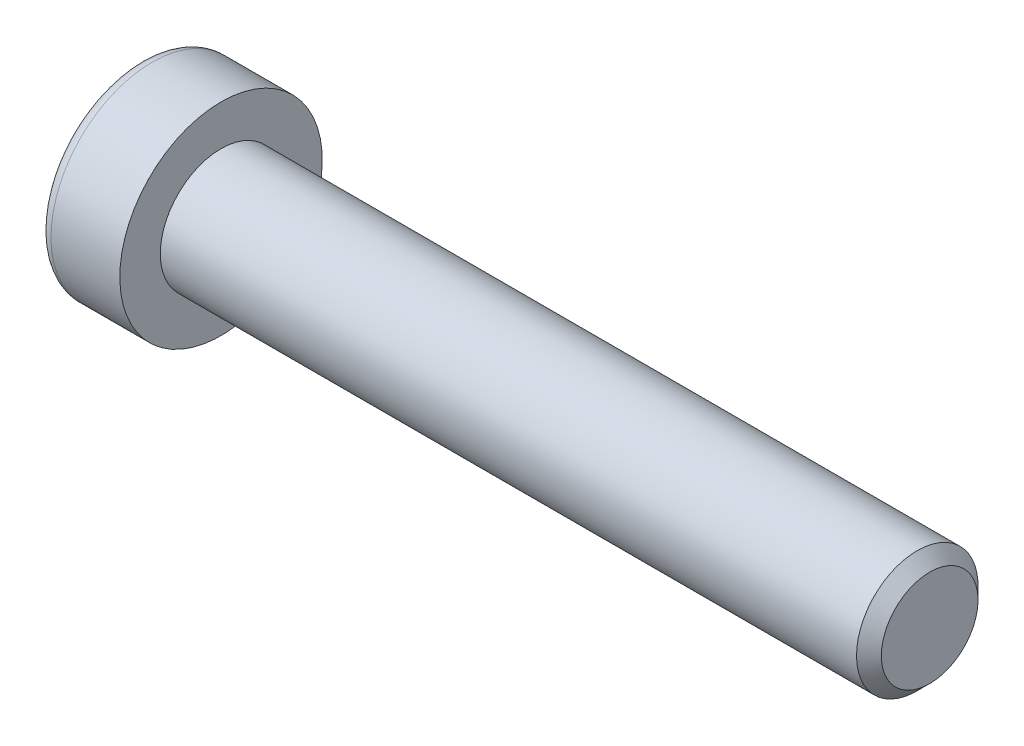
ISO-10303-21;
HEADER;
FILE_DESCRIPTION(('STEP AP214'),'2;1');
FILE_NAME('part.step','',(''),(''),'','','');
FILE_SCHEMA(('AUTOMOTIVE_DESIGN { 1 0 10303 214 1 1 1 1 }'));
ENDSEC;
DATA;
#1=APPLICATION_CONTEXT('core data for automotive mechanical design processes');
#2=APPLICATION_PROTOCOL_DEFINITION('international standard','automotive_design',2000,#1);
#3=PRODUCT_CONTEXT('',#1,'mechanical');
#4=PRODUCT('Part','Part','',(#3));
#5=PRODUCT_RELATED_PRODUCT_CATEGORY('part','',(#4));
#6=PRODUCT_DEFINITION_FORMATION('','',#4);
#7=PRODUCT_DEFINITION_CONTEXT('part definition',#1,'design');
#8=PRODUCT_DEFINITION('design','',#6,#7);
#9=PRODUCT_DEFINITION_SHAPE('','',#8);
#10=(LENGTH_UNIT() NAMED_UNIT(*) SI_UNIT(.MILLI.,.METRE.));
#11=(NAMED_UNIT(*) PLANE_ANGLE_UNIT() SI_UNIT($,.RADIAN.));
#12=(NAMED_UNIT(*) SI_UNIT($,.STERADIAN.) SOLID_ANGLE_UNIT());
#13=UNCERTAINTY_MEASURE_WITH_UNIT(LENGTH_MEASURE(1.E-05),#10,'distance_accuracy_value','');
#14=(GEOMETRIC_REPRESENTATION_CONTEXT(3) GLOBAL_UNCERTAINTY_ASSIGNED_CONTEXT((#13)) GLOBAL_UNIT_ASSIGNED_CONTEXT((#10,
#11,#12)) REPRESENTATION_CONTEXT('',''));
#15=CARTESIAN_POINT('',(0.,0.,0.));
#16=DIRECTION('',(0.,0.,1.));
#17=DIRECTION('',(1.,0.,0.));
#18=AXIS2_PLACEMENT_3D('',#15,#16,#17);
#19=CARTESIAN_POINT('',(-1.00800000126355,0.,0.));
#20=DIRECTION('',(-1.,0.,0.));
#21=DIRECTION('',(0.,0.,1.));
#22=AXIS2_PLACEMENT_3D('',#19,#20,#21);
#23=CONICAL_SURFACE('',#22,2.32325748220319,1.04719754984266);
#24=CARTESIAN_POINT('',(0.333333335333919,-2.27373675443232E-10,0.));
#25=VERTEX_POINT('',#24);
#26=VERTEX_LOOP('',#25);
#27=FACE_BOUND('',#26,.T.);
#28=CARTESIAN_POINT('',(-1.00000000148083,2.00000000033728,1.15470053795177));
#29=CARTESIAN_POINT('',(-0.970695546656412,2.00000000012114,1.05321634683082));
#30=CARTESIAN_POINT('',(-0.944044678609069,2.00000000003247,0.950856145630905));
#31=CARTESIAN_POINT('',(-0.897526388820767,1.99999999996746,0.744363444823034));
#32=CARTESIAN_POINT('',(-0.877675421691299,1.99999999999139,0.640227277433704));
#33=CARTESIAN_POINT('',(-0.84677596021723,2.0000000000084,0.433245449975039));
#34=CARTESIAN_POINT('',(-0.835521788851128,2.00000000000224,0.330431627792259));
#35=CARTESIAN_POINT('',(-0.822089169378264,1.99999999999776,0.124320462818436));
#36=CARTESIAN_POINT('',(-0.819899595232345,1.99999999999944,0.021023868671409));
#37=CARTESIAN_POINT('',(-0.824466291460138,2.00000000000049,-0.17197473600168));
#38=CARTESIAN_POINT('',(-0.830101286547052,2.00000000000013,-0.261705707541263));
#39=CARTESIAN_POINT('',(-0.847957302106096,1.99999999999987,-0.440583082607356));
#40=CARTESIAN_POINT('',(-0.86018441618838,1.99999999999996,-0.529728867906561));
#41=CARTESIAN_POINT('',(-0.890749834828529,2.00000000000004,-0.708974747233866));
#42=CARTESIAN_POINT('',(-0.909217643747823,2.00000000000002,-0.799052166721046));
#43=CARTESIAN_POINT('',(-0.95113176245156,1.99999999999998,-0.977863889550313));
#44=CARTESIAN_POINT('',(-0.974568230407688,1.99999999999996,-1.06660048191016));
#45=CARTESIAN_POINT('',(-1.00000000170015,2.,-1.15470053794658));
#46=B_SPLINE_CURVE_WITH_KNOTS('',3,(#28,#29,#30,#31,#32,#33,#34,#35,#36,#37,#38,#39,#40,#41,#42,
#43,#44,#45),.UNSPECIFIED.,.F.,.F.,(4,2,2,2,2,2,2,2,4),(0.,0.317016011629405,0.634793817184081,
0.944707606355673,1.25424088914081,1.52370778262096,1.79342419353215,2.06912162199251,
2.34427797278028),.UNSPECIFIED.);
#47=CARTESIAN_POINT('',(-1.00000000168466,1.99999999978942,1.15470053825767));
#48=VERTEX_POINT('',#47);
#49=CARTESIAN_POINT('',(-1.00000000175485,2.,-1.15470053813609));
#50=VERTEX_POINT('',#49);
#51=EDGE_CURVE('E20',#48,#50,#46,.T.);
#52=ORIENTED_EDGE('',*,*,#51,.T.);
#53=CARTESIAN_POINT('',(-1.00000000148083,1.99999999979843,-1.15470053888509));
#54=CARTESIAN_POINT('',(-0.970695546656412,1.91211211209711,-1.20544263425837));
#55=CARTESIAN_POINT('',(-0.944044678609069,1.82346557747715,-1.25662273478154));
#56=CARTESIAN_POINT('',(-0.897526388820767,1.64463765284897,-1.35986908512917));
#57=CARTESIAN_POINT('',(-0.877675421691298,1.55445308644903,-1.41193716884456));
#58=CARTESIAN_POINT('',(-0.846775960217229,1.37520156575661,-1.51542808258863));
#59=CARTESIAN_POINT('',(-0.835521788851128,1.28616218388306,-1.56683499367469));
#60=CARTESIAN_POINT('',(-0.822089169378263,1.10766467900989,-1.66989057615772));
#61=CARTESIAN_POINT('',(-0.819899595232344,1.01820720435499,-1.72153887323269));
#62=CARTESIAN_POINT('',(-0.824466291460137,0.851065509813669,-1.81803817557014));
#63=CARTESIAN_POINT('',(-0.830101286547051,0.773356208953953,-1.86290366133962));
#64=CARTESIAN_POINT('',(-0.847957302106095,0.618443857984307,-1.95234234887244));
#65=CARTESIAN_POINT('',(-0.860184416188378,0.541241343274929,-1.99691524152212));
#66=CARTESIAN_POINT('',(-0.890749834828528,0.38600985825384,-2.08653818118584));
#67=CARTESIAN_POINT('',(-0.909217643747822,0.308000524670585,-2.13157689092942));
#68=CARTESIAN_POINT('',(-0.951131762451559,0.153145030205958,-2.22098275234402));
#69=CARTESIAN_POINT('',(-0.974568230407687,0.0762968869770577,-2.26535104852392));
#70=CARTESIAN_POINT('',(-1.00000000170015,3.74707656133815E-10,-2.30940107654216));
#71=B_SPLINE_CURVE_WITH_KNOTS('',3,(#53,#54,#55,#56,#57,#58,#59,#60,#61,#62,#63,#64,#65,#66,#67,
#68,#69,#70),.UNSPECIFIED.,.F.,.F.,(4,2,2,2,2,2,2,2,4),(0.,0.317016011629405,0.63479381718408,
0.944707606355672,1.25424088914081,1.52370778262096,1.79342419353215,2.06912162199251,
2.34427797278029),.UNSPECIFIED.);
#72=CARTESIAN_POINT('',(-1.00000000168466,0.,-2.30940107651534));
#73=VERTEX_POINT('',#72);
#74=EDGE_CURVE('E80',#50,#73,#71,.T.);
#75=ORIENTED_EDGE('',*,*,#74,.T.);
#76=CARTESIAN_POINT('',(-1.00000000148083,-5.38851016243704E-10,-2.30940107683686));
#77=CARTESIAN_POINT('',(-0.970695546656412,-0.0878878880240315,-2.2586589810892));
#78=CARTESIAN_POINT('',(-0.944044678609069,-0.176534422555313,-2.20747888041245));
#79=CARTESIAN_POINT('',(-0.897526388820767,-0.355362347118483,-2.10423252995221));
#80=CARTESIAN_POINT('',(-0.877675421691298,-0.445546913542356,-2.05216444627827));
#81=CARTESIAN_POINT('',(-0.846775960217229,-0.624798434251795,-1.94867353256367));
#82=CARTESIAN_POINT('',(-0.835521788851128,-0.713837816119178,-1.89726662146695));
#83=CARTESIAN_POINT('',(-0.822089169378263,-0.892335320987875,-1.79421103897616));
#84=CARTESIAN_POINT('',(-0.819899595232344,-0.98179279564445,-1.7425627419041));
#85=CARTESIAN_POINT('',(-0.824466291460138,-1.14893449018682,-1.64606343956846));
#86=CARTESIAN_POINT('',(-0.830101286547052,-1.22664379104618,-1.60119795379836));
#87=CARTESIAN_POINT('',(-0.847957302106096,-1.38155614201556,-1.51175926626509));
#88=CARTESIAN_POINT('',(-0.860184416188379,-1.45875865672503,-1.46718637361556));
#89=CARTESIAN_POINT('',(-0.890749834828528,-1.6139901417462,-1.37756343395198));
#90=CARTESIAN_POINT('',(-0.909217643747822,-1.69199947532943,-1.33252472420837));
#91=CARTESIAN_POINT('',(-0.951131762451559,-1.84685496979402,-1.2431188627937));
#92=CARTESIAN_POINT('',(-0.974568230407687,-1.9237031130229,-1.19875056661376));
#93=CARTESIAN_POINT('',(-1.00000000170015,-1.99999999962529,-1.15470053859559));
#94=B_SPLINE_CURVE_WITH_KNOTS('',3,(#76,#77,#78,#79,#80,#81,#82,#83,#84,#85,#86,#87,#88,#89,#90,
#91,#92,#93),.UNSPECIFIED.,.F.,.F.,(4,2,2,2,2,2,2,2,4),(0.,0.317016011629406,0.634793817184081,
0.944707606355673,1.25424088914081,1.52370778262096,1.79342419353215,2.06912162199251,
2.34427797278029),.UNSPECIFIED.);
#95=CARTESIAN_POINT('',(-1.00000000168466,-1.99999999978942,-1.15470053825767));
#96=VERTEX_POINT('',#95);
#97=EDGE_CURVE('E105',#73,#96,#94,.T.);
#98=ORIENTED_EDGE('',*,*,#97,.T.);
#99=CARTESIAN_POINT('',(-1.00000000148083,-2.00000000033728,-1.15470053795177));
#100=CARTESIAN_POINT('',(-0.970695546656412,-2.00000000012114,-1.05321634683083));
#101=CARTESIAN_POINT('',(-0.944044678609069,-2.00000000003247,-0.950856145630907));
#102=CARTESIAN_POINT('',(-0.897526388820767,-1.99999999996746,-0.744363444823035));
#103=CARTESIAN_POINT('',(-0.877675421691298,-1.99999999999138,-0.640227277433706));
#104=CARTESIAN_POINT('',(-0.846775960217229,-2.0000000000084,-0.433245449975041));
#105=CARTESIAN_POINT('',(-0.835521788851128,-2.00000000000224,-0.330431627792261));
#106=CARTESIAN_POINT('',(-0.822089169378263,-1.99999999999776,-0.124320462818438));
#107=CARTESIAN_POINT('',(-0.819899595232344,-1.99999999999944,-0.0210238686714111));
#108=CARTESIAN_POINT('',(-0.824466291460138,-2.00000000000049,0.171974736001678));
#109=CARTESIAN_POINT('',(-0.830101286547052,-2.00000000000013,0.261705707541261));
#110=CARTESIAN_POINT('',(-0.847957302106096,-1.99999999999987,0.440583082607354));
#111=CARTESIAN_POINT('',(-0.860184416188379,-1.99999999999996,0.52972886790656));
#112=CARTESIAN_POINT('',(-0.890749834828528,-2.00000000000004,0.708974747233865));
#113=CARTESIAN_POINT('',(-0.909217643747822,-2.00000000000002,0.799052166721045));
#114=CARTESIAN_POINT('',(-0.951131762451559,-1.99999999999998,0.977863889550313));
#115=CARTESIAN_POINT('',(-0.974568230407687,-1.99999999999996,1.06660048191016));
#116=CARTESIAN_POINT('',(-1.00000000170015,-2.,1.15470053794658));
#117=B_SPLINE_CURVE_WITH_KNOTS('',3,(#99,#100,#101,#102,#103,#104,#105,#106,#107,#108,#109,#110,
#111,#112,#113,#114,#115,#116),.UNSPECIFIED.,.F.,.F.,(4,2,2,2,2,2,2,2,4),(0.,0.317016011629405,
0.63479381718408,0.944707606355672,1.25424088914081,1.52370778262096,1.79342419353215,
2.06912162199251,2.34427797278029),.UNSPECIFIED.);
#118=CARTESIAN_POINT('',(-1.00000000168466,-1.99999999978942,1.15470053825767));
#119=VERTEX_POINT('',#118);
#120=EDGE_CURVE('E129',#96,#119,#117,.T.);
#121=ORIENTED_EDGE('',*,*,#120,.T.);
#122=CARTESIAN_POINT('',(-1.00000000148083,-1.99999999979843,1.15470053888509));
#123=CARTESIAN_POINT('',(-0.970695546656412,-1.91211211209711,1.20544263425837));
#124=CARTESIAN_POINT('',(-0.944044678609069,-1.82346557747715,1.25662273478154));
#125=CARTESIAN_POINT('',(-0.897526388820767,-1.64463765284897,1.35986908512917));
#126=CARTESIAN_POINT('',(-0.877675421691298,-1.55445308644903,1.41193716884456));
#127=CARTESIAN_POINT('',(-0.846775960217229,-1.37520156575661,1.51542808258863));
#128=CARTESIAN_POINT('',(-0.835521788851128,-1.28616218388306,1.56683499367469));
#129=CARTESIAN_POINT('',(-0.822089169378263,-1.10766467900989,1.66989057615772));
#130=CARTESIAN_POINT('',(-0.819899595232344,-1.01820720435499,1.72153887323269));
#131=CARTESIAN_POINT('',(-0.824466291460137,-0.85106550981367,1.81803817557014));
#132=CARTESIAN_POINT('',(-0.830101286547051,-0.773356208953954,1.86290366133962));
#133=CARTESIAN_POINT('',(-0.847957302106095,-0.618443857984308,1.95234234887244));
#134=CARTESIAN_POINT('',(-0.860184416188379,-0.54124134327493,1.99691524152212));
#135=CARTESIAN_POINT('',(-0.890749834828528,-0.386009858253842,2.08653818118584));
#136=CARTESIAN_POINT('',(-0.909217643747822,-0.308000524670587,2.13157689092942));
#137=CARTESIAN_POINT('',(-0.951131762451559,-0.15314503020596,2.22098275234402));
#138=CARTESIAN_POINT('',(-0.974568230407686,-0.0762968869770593,2.26535104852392));
#139=CARTESIAN_POINT('',(-1.00000000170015,-3.74709270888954E-10,2.30940107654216));
#140=B_SPLINE_CURVE_WITH_KNOTS('',3,(#122,#123,#124,#125,#126,#127,#128,#129,#130,#131,#132,
#133,#134,#135,#136,#137,#138,#139),.UNSPECIFIED.,.F.,.F.,(4,2,2,2,2,2,2,2,4),(0.,
0.317016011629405,0.63479381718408,0.944707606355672,1.25424088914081,1.52370778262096,
1.79342419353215,2.06912162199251,2.34427797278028),.UNSPECIFIED.);
#141=CARTESIAN_POINT('',(-1.00000000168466,0.,2.30940107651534));
#142=VERTEX_POINT('',#141);
#143=EDGE_CURVE('E137',#119,#142,#140,.T.);
#144=ORIENTED_EDGE('',*,*,#143,.T.);
#145=CARTESIAN_POINT('',(-1.00000000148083,5.38850869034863E-10,2.30940107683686));
#146=CARTESIAN_POINT('',(-0.970695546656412,0.0878878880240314,2.2586589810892));
#147=CARTESIAN_POINT('',(-0.944044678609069,0.176534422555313,2.20747888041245));
#148=CARTESIAN_POINT('',(-0.897526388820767,0.355362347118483,2.10423252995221));
#149=CARTESIAN_POINT('',(-0.877675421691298,0.445546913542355,2.05216444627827));
#150=CARTESIAN_POINT('',(-0.846775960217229,0.624798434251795,1.94867353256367));
#151=CARTESIAN_POINT('',(-0.835521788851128,0.713837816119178,1.89726662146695));
#152=CARTESIAN_POINT('',(-0.822089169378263,0.892335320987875,1.79421103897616));
#153=CARTESIAN_POINT('',(-0.819899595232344,0.981792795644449,1.7425627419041));
#154=CARTESIAN_POINT('',(-0.824466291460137,1.14893449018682,1.64606343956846));
#155=CARTESIAN_POINT('',(-0.830101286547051,1.22664379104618,1.60119795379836));
#156=CARTESIAN_POINT('',(-0.847957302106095,1.38155614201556,1.51175926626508));
#157=CARTESIAN_POINT('',(-0.860184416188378,1.45875865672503,1.46718637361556));
#158=CARTESIAN_POINT('',(-0.890749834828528,1.6139901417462,1.37756343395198));
#159=CARTESIAN_POINT('',(-0.909217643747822,1.69199947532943,1.33252472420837));
#160=CARTESIAN_POINT('',(-0.951131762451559,1.84685496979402,1.2431188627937));
#161=CARTESIAN_POINT('',(-0.974568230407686,1.9237031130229,1.19875056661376));
#162=CARTESIAN_POINT('',(-1.00000000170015,1.99999999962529,1.15470053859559));
#163=B_SPLINE_CURVE_WITH_KNOTS('',3,(#145,#146,#147,#148,#149,#150,#151,#152,#153,#154,#155,
#156,#157,#158,#159,#160,#161,#162),.UNSPECIFIED.,.F.,.F.,(4,2,2,2,2,2,2,2,4),(0.,
0.317016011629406,0.63479381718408,0.944707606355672,1.25424088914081,1.52370778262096,
1.79342419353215,2.06912162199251,2.34427797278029),.UNSPECIFIED.);
#164=EDGE_CURVE('E82',#142,#48,#163,.T.);
#165=ORIENTED_EDGE('',*,*,#164,.T.);
#166=EDGE_LOOP('',(#52,#75,#98,#121,#144,#165));
#167=FACE_BOUND('',#166,.T.);
#168=ADVANCED_FACE('F16',(#27,#167),#23,.F.);
#169=CARTESIAN_POINT('',(-3.99999999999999,2.,1.15470053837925));
#170=DIRECTION('',(0.,1.,0.));
#171=DIRECTION('',(0.,0.,1.));
#172=AXIS2_PLACEMENT_3D('',#169,#170,#171);
#173=PLANE('',#172);
#174=DIRECTION('',(1.,0.,0.));
#175=VECTOR('',#174,1.);
#176=CARTESIAN_POINT('',(-3.99999999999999,2.,1.15470053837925));
#177=LINE('',#176,#175);
#178=CARTESIAN_POINT('',(-3.99999999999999,2.,1.15470053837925));
#179=VERTEX_POINT('',#178);
#180=EDGE_CURVE('E84',#48,#179,#177,.F.);
#181=ORIENTED_EDGE('',*,*,#180,.T.);
#182=DIRECTION('',(0.,0.,1.));
#183=VECTOR('',#182,1.);
#184=CARTESIAN_POINT('',(-3.99999999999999,2.,0.));
#185=LINE('',#184,#183);
#186=CARTESIAN_POINT('',(-3.99999999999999,2.,-1.15470053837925));
#187=VERTEX_POINT('',#186);
#188=EDGE_CURVE('E89',#187,#179,#185,.T.);
#189=ORIENTED_EDGE('',*,*,#188,.F.);
#190=DIRECTION('',(1.,0.,0.));
#191=VECTOR('',#190,1.);
#192=CARTESIAN_POINT('',(-3.99999999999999,2.,-1.15470053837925));
#193=LINE('',#192,#191);
#194=EDGE_CURVE('E87',#187,#50,#193,.T.);
#195=ORIENTED_EDGE('',*,*,#194,.T.);
#196=ORIENTED_EDGE('',*,*,#51,.F.);
#197=EDGE_LOOP('',(#181,#189,#195,#196));
#198=FACE_BOUND('',#197,.T.);
#199=ADVANCED_FACE('F76',(#198),#173,.F.);
#200=CARTESIAN_POINT('',(-3.99999999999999,0.,2.3094010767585));
#201=DIRECTION('',(0.,0.500000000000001,0.866025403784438));
#202=DIRECTION('',(0.,-0.866025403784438,0.500000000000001));
#203=AXIS2_PLACEMENT_3D('',#200,#201,#202);
#204=PLANE('',#203);
#205=DIRECTION('',(1.,0.,0.));
#206=VECTOR('',#205,1.);
#207=CARTESIAN_POINT('',(-3.99999999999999,0.,2.3094010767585));
#208=LINE('',#207,#206);
#209=CARTESIAN_POINT('',(-3.99999999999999,0.,2.3094010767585));
#210=VERTEX_POINT('',#209);
#211=EDGE_CURVE('E141',#142,#210,#208,.F.);
#212=ORIENTED_EDGE('',*,*,#211,.T.);
#213=DIRECTION('',(0.,-0.866025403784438,0.500000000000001));
#214=VECTOR('',#213,1.);
#215=CARTESIAN_POINT('',(-3.99999999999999,2.,1.15470053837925));
#216=LINE('',#215,#214);
#217=EDGE_CURVE('E95',#179,#210,#216,.T.);
#218=ORIENTED_EDGE('',*,*,#217,.F.);
#219=ORIENTED_EDGE('',*,*,#180,.F.);
#220=ORIENTED_EDGE('',*,*,#164,.F.);
#221=EDGE_LOOP('',(#212,#218,#219,#220));
#222=FACE_BOUND('',#221,.T.);
#223=ADVANCED_FACE('F145',(#222),#204,.F.);
#224=CARTESIAN_POINT('',(-3.99999999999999,-2.,1.15470053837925));
#225=DIRECTION('',(0.,-0.5,0.866025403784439));
#226=DIRECTION('',(0.,-0.866025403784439,-0.5));
#227=AXIS2_PLACEMENT_3D('',#224,#225,#226);
#228=PLANE('',#227);
#229=DIRECTION('',(1.,0.,0.));
#230=VECTOR('',#229,1.);
#231=CARTESIAN_POINT('',(-3.99999999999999,-2.,1.15470053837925));
#232=LINE('',#231,#230);
#233=CARTESIAN_POINT('',(-3.99999999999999,-2.,1.15470053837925));
#234=VERTEX_POINT('',#233);
#235=EDGE_CURVE('E136',#119,#234,#232,.F.);
#236=ORIENTED_EDGE('',*,*,#235,.T.);
#237=DIRECTION('',(0.,-0.866025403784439,-0.5));
#238=VECTOR('',#237,1.);
#239=CARTESIAN_POINT('',(-3.99999999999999,0.,2.3094010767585));
#240=LINE('',#239,#238);
#241=EDGE_CURVE('E224',#210,#234,#240,.T.);
#242=ORIENTED_EDGE('',*,*,#241,.F.);
#243=ORIENTED_EDGE('',*,*,#211,.F.);
#244=ORIENTED_EDGE('',*,*,#143,.F.);
#245=EDGE_LOOP('',(#236,#242,#243,#244));
#246=FACE_BOUND('',#245,.T.);
#247=ADVANCED_FACE('F125',(#246),#228,.F.);
#248=CARTESIAN_POINT('',(-3.99999999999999,-2.,-1.15470053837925));
#249=DIRECTION('',(0.,-1.,0.));
#250=DIRECTION('',(0.,0.,-1.));
#251=AXIS2_PLACEMENT_3D('',#248,#249,#250);
#252=PLANE('',#251);
#253=DIRECTION('',(1.,0.,0.));
#254=VECTOR('',#253,1.);
#255=CARTESIAN_POINT('',(-3.99999999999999,-2.,-1.15470053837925));
#256=LINE('',#255,#254);
#257=CARTESIAN_POINT('',(-3.99999999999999,-2.,-1.15470053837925));
#258=VERTEX_POINT('',#257);
#259=EDGE_CURVE('E135',#96,#258,#256,.F.);
#260=ORIENTED_EDGE('',*,*,#259,.T.);
#261=DIRECTION('',(0.,0.,1.));
#262=VECTOR('',#261,1.);
#263=CARTESIAN_POINT('',(-3.99999999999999,-2.,0.));
#264=LINE('',#263,#262);
#265=EDGE_CURVE('E221',#234,#258,#264,.F.);
#266=ORIENTED_EDGE('',*,*,#265,.F.);
#267=ORIENTED_EDGE('',*,*,#235,.F.);
#268=ORIENTED_EDGE('',*,*,#120,.F.);
#269=EDGE_LOOP('',(#260,#266,#267,#268));
#270=FACE_BOUND('',#269,.T.);
#271=ADVANCED_FACE('F121',(#270),#252,.F.);
#272=CARTESIAN_POINT('',(-3.99999999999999,0.,-2.3094010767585));
#273=DIRECTION('',(0.,-0.5,-0.866025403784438));
#274=DIRECTION('',(0.,0.866025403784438,-0.5));
#275=AXIS2_PLACEMENT_3D('',#272,#273,#274);
#276=PLANE('',#275);
#277=DIRECTION('',(1.,0.,0.));
#278=VECTOR('',#277,1.);
#279=CARTESIAN_POINT('',(-3.99999999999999,0.,-2.3094010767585));
#280=LINE('',#279,#278);
#281=CARTESIAN_POINT('',(-3.99999999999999,0.,-2.3094010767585));
#282=VERTEX_POINT('',#281);
#283=EDGE_CURVE('E38',#73,#282,#280,.F.);
#284=ORIENTED_EDGE('',*,*,#283,.T.);
#285=DIRECTION('',(0.,0.866025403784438,-0.5));
#286=VECTOR('',#285,1.);
#287=CARTESIAN_POINT('',(-3.99999999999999,-2.,-1.15470053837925));
#288=LINE('',#287,#286);
#289=EDGE_CURVE('E218',#258,#282,#288,.T.);
#290=ORIENTED_EDGE('',*,*,#289,.F.);
#291=ORIENTED_EDGE('',*,*,#259,.F.);
#292=ORIENTED_EDGE('',*,*,#97,.F.);
#293=EDGE_LOOP('',(#284,#290,#291,#292));
#294=FACE_BOUND('',#293,.T.);
#295=ADVANCED_FACE('F115',(#294),#276,.F.);
#296=CARTESIAN_POINT('',(-3.99999999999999,2.,-1.15470053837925));
#297=DIRECTION('',(0.,0.5,-0.866025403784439));
#298=DIRECTION('',(0.,0.866025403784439,0.5));
#299=AXIS2_PLACEMENT_3D('',#296,#297,#298);
#300=PLANE('',#299);
#301=ORIENTED_EDGE('',*,*,#194,.F.);
#302=DIRECTION('',(0.,0.866025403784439,0.5));
#303=VECTOR('',#302,1.);
#304=CARTESIAN_POINT('',(-3.99999999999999,0.,-2.3094010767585));
#305=LINE('',#304,#303);
#306=EDGE_CURVE('E216',#282,#187,#305,.T.);
#307=ORIENTED_EDGE('',*,*,#306,.F.);
#308=ORIENTED_EDGE('',*,*,#283,.F.);
#309=ORIENTED_EDGE('',*,*,#74,.F.);
#310=EDGE_LOOP('',(#301,#307,#308,#309));
#311=FACE_BOUND('',#310,.T.);
#312=ADVANCED_FACE('F93',(#311),#300,.F.);
#313=CARTESIAN_POINT('',(-3.99999999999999,3.65470053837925,0.));
#314=DIRECTION('',(-1.,0.,0.));
#315=DIRECTION('',(0.,0.,1.));
#316=AXIS2_PLACEMENT_3D('',#313,#314,#315);
#317=PLANE('',#316);
#318=ORIENTED_EDGE('',*,*,#289,.T.);
#319=ORIENTED_EDGE('',*,*,#306,.T.);
#320=ORIENTED_EDGE('',*,*,#188,.T.);
#321=ORIENTED_EDGE('',*,*,#217,.T.);
#322=ORIENTED_EDGE('',*,*,#241,.T.);
#323=ORIENTED_EDGE('',*,*,#265,.T.);
#324=EDGE_LOOP('',(#318,#319,#320,#321,#322,#323));
#325=FACE_BOUND('',#324,.T.);
#326=CARTESIAN_POINT('',(-3.99999999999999,0.,0.));
#327=DIRECTION('',(1.,0.,0.));
#328=DIRECTION('',(0.,1.,0.));
#329=AXIS2_PLACEMENT_3D('',#326,#327,#328);
#330=CIRCLE('',#329,4.4);
#331=CARTESIAN_POINT('',(-3.99999999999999,4.4,0.));
#332=VERTEX_POINT('',#331);
#333=EDGE_CURVE('E193',#332,#332,#330,.T.);
#334=ORIENTED_EDGE('',*,*,#333,.F.);
#335=EDGE_LOOP('',(#334));
#336=FACE_BOUND('',#335,.T.);
#337=ADVANCED_FACE('F114',(#325,#336),#317,.T.);
#338=CARTESIAN_POINT('',(-3.4,0.,0.));
#339=DIRECTION('',(1.,0.,0.));
#340=DIRECTION('',(0.,0.,-1.));
#341=AXIS2_PLACEMENT_3D('',#338,#339,#340);
#342=TOROIDAL_SURFACE('',#341,4.4,0.6);
#343=CARTESIAN_POINT('',(-3.4,0.,0.));
#344=DIRECTION('',(1.,0.,0.));
#345=DIRECTION('',(0.,1.,0.));
#346=AXIS2_PLACEMENT_3D('',#343,#344,#345);
#347=CIRCLE('',#346,5.);
#348=CARTESIAN_POINT('',(-3.4,5.,0.));
#349=VERTEX_POINT('',#348);
#350=EDGE_CURVE('E234',#349,#349,#347,.T.);
#351=ORIENTED_EDGE('',*,*,#350,.F.);
#352=EDGE_LOOP('',(#351));
#353=FACE_BOUND('',#352,.T.);
#354=ORIENTED_EDGE('',*,*,#333,.T.);
#355=EDGE_LOOP('',(#354));
#356=FACE_BOUND('',#355,.T.);
#357=ADVANCED_FACE('F177',(#353,#356),#342,.T.);
#358=CARTESIAN_POINT('',(-2.,0.,0.));
#359=DIRECTION('',(1.,0.,0.));
#360=DIRECTION('',(0.,1.,0.));
#361=AXIS2_PLACEMENT_3D('',#358,#359,#360);
#362=CYLINDRICAL_SURFACE('',#361,5.);
#363=ORIENTED_EDGE('',*,*,#350,.T.);
#364=EDGE_LOOP('',(#363));
#365=FACE_BOUND('',#364,.T.);
#366=CARTESIAN_POINT('',(0.,0.,0.));
#367=DIRECTION('',(1.,0.,0.));
#368=DIRECTION('',(0.,1.,0.));
#369=AXIS2_PLACEMENT_3D('',#366,#367,#368);
#370=CIRCLE('',#369,5.);
#371=CARTESIAN_POINT('',(0.,5.,0.));
#372=VERTEX_POINT('',#371);
#373=EDGE_CURVE('E103',#372,#372,#370,.T.);
#374=ORIENTED_EDGE('',*,*,#373,.F.);
#375=EDGE_LOOP('',(#374));
#376=FACE_BOUND('',#375,.T.);
#377=ADVANCED_FACE('F174',(#365,#376),#362,.T.);
#378=CARTESIAN_POINT('',(35.,1.5,0.));
#379=DIRECTION('',(1.,0.,0.));
#380=DIRECTION('',(0.,0.,-1.));
#381=AXIS2_PLACEMENT_3D('',#378,#379,#380);
#382=PLANE('',#381);
#383=CARTESIAN_POINT('',(35.0000000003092,0.,0.));
#384=DIRECTION('',(-1.,0.,0.));
#385=DIRECTION('',(0.,0.,1.));
#386=AXIS2_PLACEMENT_3D('',#383,#384,#385);
#387=CIRCLE('',#386,2.38655000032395);
#388=CARTESIAN_POINT('',(35.0000000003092,0.,2.38655000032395));
#389=VERTEX_POINT('',#388);
#390=EDGE_CURVE('E230',#389,#389,#387,.T.);
#391=ORIENTED_EDGE('',*,*,#390,.F.);
#392=EDGE_LOOP('',(#391));
#393=FACE_BOUND('',#392,.T.);
#394=ADVANCED_FACE('F170',(#393),#382,.T.);
#395=CARTESIAN_POINT('',(0.,4.,0.));
#396=DIRECTION('',(1.,0.,0.));
#397=DIRECTION('',(0.,0.,-1.));
#398=AXIS2_PLACEMENT_3D('',#395,#396,#397);
#399=PLANE('',#398);
#400=CARTESIAN_POINT('',(0.,0.,0.));
#401=DIRECTION('',(1.,0.,0.));
#402=DIRECTION('',(0.,1.,0.));
#403=AXIS2_PLACEMENT_3D('',#400,#401,#402);
#404=CIRCLE('',#403,3.);
#405=CARTESIAN_POINT('',(0.,3.,0.));
#406=VERTEX_POINT('',#405);
#407=EDGE_CURVE('E29',#406,#406,#404,.T.);
#408=ORIENTED_EDGE('',*,*,#407,.F.);
#409=EDGE_LOOP('',(#408));
#410=FACE_BOUND('',#409,.T.);
#411=ORIENTED_EDGE('',*,*,#373,.T.);
#412=EDGE_LOOP('',(#411));
#413=FACE_BOUND('',#412,.T.);
#414=ADVANCED_FACE('F163',(#410,#413),#399,.T.);
#415=CARTESIAN_POINT('',(34.3865499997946,0.,0.));
#416=DIRECTION('',(-1.,0.,0.));
#417=DIRECTION('',(0.,0.,1.));
#418=AXIS2_PLACEMENT_3D('',#415,#416,#417);
#419=CONICAL_SURFACE('',#418,2.99999999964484,0.785398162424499);
#420=ORIENTED_EDGE('',*,*,#390,.T.);
#421=EDGE_LOOP('',(#420));
#422=FACE_BOUND('',#421,.T.);
#423=CARTESIAN_POINT('',(34.38655,0.,0.));
#424=DIRECTION('',(1.,0.,0.));
#425=DIRECTION('',(0.,1.,0.));
#426=AXIS2_PLACEMENT_3D('',#423,#424,#425);
#427=CIRCLE('',#426,3.);
#428=CARTESIAN_POINT('',(34.38655,3.,0.));
#429=VERTEX_POINT('',#428);
#430=EDGE_CURVE('E11',#429,#429,#427,.F.);
#431=ORIENTED_EDGE('',*,*,#430,.F.);
#432=EDGE_LOOP('',(#431));
#433=FACE_BOUND('',#432,.T.);
#434=ADVANCED_FACE('F156',(#422,#433),#419,.T.);
#435=CARTESIAN_POINT('',(26.,0.,0.));
#436=DIRECTION('',(1.,0.,0.));
#437=DIRECTION('',(0.,1.,0.));
#438=AXIS2_PLACEMENT_3D('',#435,#436,#437);
#439=CYLINDRICAL_SURFACE('',#438,3.);
#440=ORIENTED_EDGE('',*,*,#430,.T.);
#441=EDGE_LOOP('',(#440));
#442=FACE_BOUND('',#441,.T.);
#443=ORIENTED_EDGE('',*,*,#407,.T.);
#444=EDGE_LOOP('',(#443));
#445=FACE_BOUND('',#444,.T.);
#446=ADVANCED_FACE('F154',(#442,#445),#439,.T.);
#447=CLOSED_SHELL('',(#168,#199,#223,#247,#271,#295,#312,#337,#357,#377,#394,#414,#434,#446));
#448=MANIFOLD_SOLID_BREP('B1',#447);
#449=ADVANCED_BREP_SHAPE_REPRESENTATION('',(#18,#448),#14);
#450=SHAPE_DEFINITION_REPRESENTATION(#9,#449);
ENDSEC;
END-ISO-10303-21;
